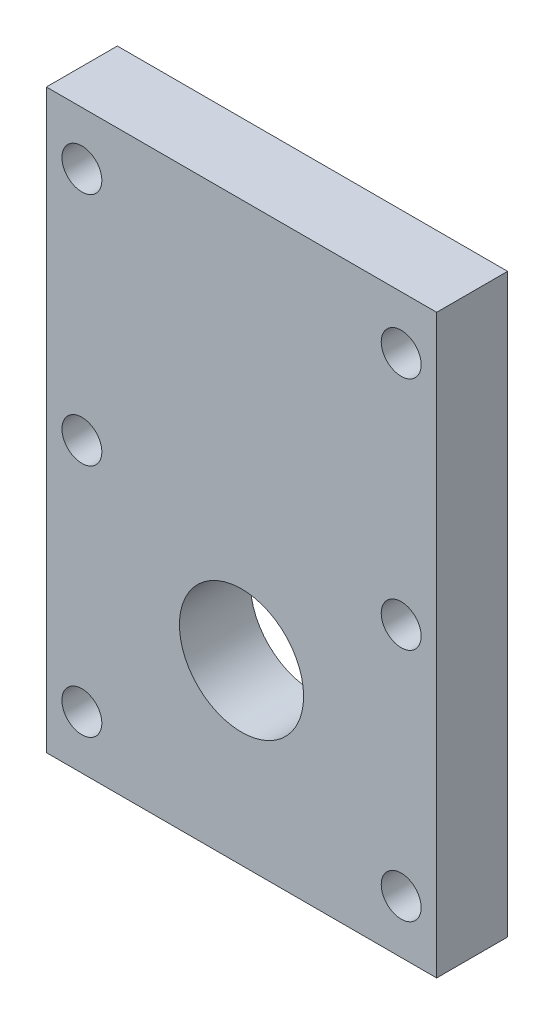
ISO-10303-21;
HEADER;
FILE_DESCRIPTION(('STEP AP214'),'2;1');
FILE_NAME('part.step','',(''),(''),'','','');
FILE_SCHEMA(('AUTOMOTIVE_DESIGN { 1 0 10303 214 1 1 1 1 }'));
ENDSEC;
DATA;
#1=APPLICATION_CONTEXT('core data for automotive mechanical design processes');
#2=APPLICATION_PROTOCOL_DEFINITION('international standard','automotive_design',2000,#1);
#3=PRODUCT_CONTEXT('',#1,'mechanical');
#4=PRODUCT('Part','Part','',(#3));
#5=PRODUCT_RELATED_PRODUCT_CATEGORY('part','',(#4));
#6=PRODUCT_DEFINITION_FORMATION('','',#4);
#7=PRODUCT_DEFINITION_CONTEXT('part definition',#1,'design');
#8=PRODUCT_DEFINITION('design','',#6,#7);
#9=PRODUCT_DEFINITION_SHAPE('','',#8);
#10=(LENGTH_UNIT() NAMED_UNIT(*) SI_UNIT(.MILLI.,.METRE.));
#11=(NAMED_UNIT(*) PLANE_ANGLE_UNIT() SI_UNIT($,.RADIAN.));
#12=(NAMED_UNIT(*) SI_UNIT($,.STERADIAN.) SOLID_ANGLE_UNIT());
#13=UNCERTAINTY_MEASURE_WITH_UNIT(LENGTH_MEASURE(1.E-05),#10,'distance_accuracy_value','');
#14=(GEOMETRIC_REPRESENTATION_CONTEXT(3) GLOBAL_UNCERTAINTY_ASSIGNED_CONTEXT((#13)) GLOBAL_UNIT_ASSIGNED_CONTEXT((#10,
#11,#12)) REPRESENTATION_CONTEXT('',''));
#15=CARTESIAN_POINT('',(0.,0.,0.));
#16=DIRECTION('',(0.,0.,1.));
#17=DIRECTION('',(1.,0.,0.));
#18=AXIS2_PLACEMENT_3D('',#15,#16,#17);
#19=CARTESIAN_POINT('',(-22.,-32.5,8.));
#20=DIRECTION('',(0.,0.,1.));
#21=DIRECTION('',(1.,0.,0.));
#22=AXIS2_PLACEMENT_3D('',#19,#20,#21);
#23=PLANE('',#22);
#24=CARTESIAN_POINT('',(-18.,0.,8.));
#25=DIRECTION('',(0.,0.,-1.));
#26=DIRECTION('',(-1.,0.,0.));
#27=AXIS2_PLACEMENT_3D('',#24,#25,#26);
#28=CIRCLE('',#27,2.25);
#29=CARTESIAN_POINT('',(-20.25,0.,8.));
#30=VERTEX_POINT('',#29);
#31=EDGE_CURVE('E99',#30,#30,#28,.T.);
#32=ORIENTED_EDGE('',*,*,#31,.T.);
#33=EDGE_LOOP('',(#32));
#34=FACE_BOUND('',#33,.T.);
#35=CARTESIAN_POINT('',(-18.,26.5,8.));
#36=DIRECTION('',(0.,0.,-1.));
#37=DIRECTION('',(-1.,0.,0.));
#38=AXIS2_PLACEMENT_3D('',#35,#36,#37);
#39=CIRCLE('',#38,2.25);
#40=CARTESIAN_POINT('',(-20.25,26.5,8.));
#41=VERTEX_POINT('',#40);
#42=EDGE_CURVE('E102',#41,#41,#39,.T.);
#43=ORIENTED_EDGE('',*,*,#42,.T.);
#44=EDGE_LOOP('',(#43));
#45=FACE_BOUND('',#44,.T.);
#46=CARTESIAN_POINT('',(18.,-26.5,8.));
#47=DIRECTION('',(0.,0.,-1.));
#48=DIRECTION('',(-1.,0.,0.));
#49=AXIS2_PLACEMENT_3D('',#46,#47,#48);
#50=CIRCLE('',#49,2.25);
#51=CARTESIAN_POINT('',(15.75,-26.5,8.));
#52=VERTEX_POINT('',#51);
#53=EDGE_CURVE('E105',#52,#52,#50,.T.);
#54=ORIENTED_EDGE('',*,*,#53,.T.);
#55=EDGE_LOOP('',(#54));
#56=FACE_BOUND('',#55,.T.);
#57=DIRECTION('',(0.,1.,0.));
#58=VECTOR('',#57,1.);
#59=CARTESIAN_POINT('',(22.,32.5,8.));
#60=LINE('',#59,#58);
#61=CARTESIAN_POINT('',(22.,-32.5,8.));
#62=VERTEX_POINT('',#61);
#63=CARTESIAN_POINT('',(22.,32.5,8.));
#64=VERTEX_POINT('',#63);
#65=EDGE_CURVE('E55',#62,#64,#60,.T.);
#66=ORIENTED_EDGE('',*,*,#65,.T.);
#67=DIRECTION('',(1.,0.,0.));
#68=VECTOR('',#67,1.);
#69=CARTESIAN_POINT('',(-22.,32.5,8.));
#70=LINE('',#69,#68);
#71=CARTESIAN_POINT('',(-22.,32.5,8.));
#72=VERTEX_POINT('',#71);
#73=EDGE_CURVE('E303',#64,#72,#70,.F.);
#74=ORIENTED_EDGE('',*,*,#73,.T.);
#75=DIRECTION('',(0.,1.,0.));
#76=VECTOR('',#75,1.);
#77=CARTESIAN_POINT('',(-22.,32.5,8.));
#78=LINE('',#77,#76);
#79=CARTESIAN_POINT('',(-22.,-32.5,8.));
#80=VERTEX_POINT('',#79);
#81=EDGE_CURVE('E60',#72,#80,#78,.F.);
#82=ORIENTED_EDGE('',*,*,#81,.T.);
#83=DIRECTION('',(1.,0.,0.));
#84=VECTOR('',#83,1.);
#85=CARTESIAN_POINT('',(-22.,-32.5,8.));
#86=LINE('',#85,#84);
#87=EDGE_CURVE('E58',#80,#62,#86,.T.);
#88=ORIENTED_EDGE('',*,*,#87,.T.);
#89=EDGE_LOOP('',(#66,#74,#82,#88));
#90=FACE_BOUND('',#89,.T.);
#91=CARTESIAN_POINT('',(18.,26.5,8.));
#92=DIRECTION('',(0.,0.,-1.));
#93=DIRECTION('',(-1.,0.,0.));
#94=AXIS2_PLACEMENT_3D('',#91,#92,#93);
#95=CIRCLE('',#94,2.25);
#96=CARTESIAN_POINT('',(15.75,26.5,8.));
#97=VERTEX_POINT('',#96);
#98=EDGE_CURVE('E66',#97,#97,#95,.T.);
#99=ORIENTED_EDGE('',*,*,#98,.T.);
#100=EDGE_LOOP('',(#99));
#101=FACE_BOUND('',#100,.T.);
#102=CARTESIAN_POINT('',(-18.,-26.5,8.));
#103=DIRECTION('',(0.,0.,-1.));
#104=DIRECTION('',(-1.,0.,0.));
#105=AXIS2_PLACEMENT_3D('',#102,#103,#104);
#106=CIRCLE('',#105,2.25);
#107=CARTESIAN_POINT('',(-20.25,-26.5,8.));
#108=VERTEX_POINT('',#107);
#109=EDGE_CURVE('E111',#108,#108,#106,.T.);
#110=ORIENTED_EDGE('',*,*,#109,.T.);
#111=EDGE_LOOP('',(#110));
#112=FACE_BOUND('',#111,.T.);
#113=CARTESIAN_POINT('',(18.,0.,8.));
#114=DIRECTION('',(0.,0.,-1.));
#115=DIRECTION('',(-1.,0.,0.));
#116=AXIS2_PLACEMENT_3D('',#113,#114,#115);
#117=CIRCLE('',#116,2.25);
#118=CARTESIAN_POINT('',(15.75,0.,8.));
#119=VERTEX_POINT('',#118);
#120=EDGE_CURVE('E113',#119,#119,#117,.T.);
#121=ORIENTED_EDGE('',*,*,#120,.T.);
#122=EDGE_LOOP('',(#121));
#123=FACE_BOUND('',#122,.T.);
#124=CARTESIAN_POINT('',(0.,-12.5,8.));
#125=DIRECTION('',(0.,0.,1.));
#126=DIRECTION('',(1.,0.,0.));
#127=AXIS2_PLACEMENT_3D('',#124,#125,#126);
#128=CIRCLE('',#127,7.);
#129=CARTESIAN_POINT('',(7.,-12.5,8.));
#130=VERTEX_POINT('',#129);
#131=EDGE_CURVE('E19',#130,#130,#128,.F.);
#132=ORIENTED_EDGE('',*,*,#131,.T.);
#133=EDGE_LOOP('',(#132));
#134=FACE_BOUND('',#133,.T.);
#135=ADVANCED_FACE('F16',(#34,#45,#56,#90,#101,#112,#123,#134),#23,.T.);
#136=CARTESIAN_POINT('',(0.,-12.5,8.));
#137=DIRECTION('',(0.,0.,1.));
#138=DIRECTION('',(1.,0.,0.));
#139=AXIS2_PLACEMENT_3D('',#136,#137,#138);
#140=CYLINDRICAL_SURFACE('',#139,7.);
#141=CARTESIAN_POINT('',(0.,-12.5,0.));
#142=DIRECTION('',(0.,0.,1.));
#143=DIRECTION('',(1.,0.,0.));
#144=AXIS2_PLACEMENT_3D('',#141,#142,#143);
#145=CIRCLE('',#144,7.);
#146=CARTESIAN_POINT('',(7.,-12.5,0.));
#147=VERTEX_POINT('',#146);
#148=EDGE_CURVE('E96',#147,#147,#145,.F.);
#149=ORIENTED_EDGE('',*,*,#148,.T.);
#150=EDGE_LOOP('',(#149));
#151=FACE_BOUND('',#150,.T.);
#152=ORIENTED_EDGE('',*,*,#131,.F.);
#153=EDGE_LOOP('',(#152));
#154=FACE_BOUND('',#153,.T.);
#155=ADVANCED_FACE('F121',(#151,#154),#140,.F.);
#156=CARTESIAN_POINT('',(18.,0.,8.));
#157=DIRECTION('',(0.,0.,-1.));
#158=DIRECTION('',(-1.,0.,0.));
#159=AXIS2_PLACEMENT_3D('',#156,#157,#158);
#160=CYLINDRICAL_SURFACE('',#159,2.25);
#161=CARTESIAN_POINT('',(18.,0.,0.));
#162=DIRECTION('',(0.,0.,-1.));
#163=DIRECTION('',(-1.,0.,0.));
#164=AXIS2_PLACEMENT_3D('',#161,#162,#163);
#165=CIRCLE('',#164,2.25);
#166=CARTESIAN_POINT('',(15.75,0.,0.));
#167=VERTEX_POINT('',#166);
#168=EDGE_CURVE('E93',#167,#167,#165,.T.);
#169=ORIENTED_EDGE('',*,*,#168,.T.);
#170=EDGE_LOOP('',(#169));
#171=FACE_BOUND('',#170,.T.);
#172=ORIENTED_EDGE('',*,*,#120,.F.);
#173=EDGE_LOOP('',(#172));
#174=FACE_BOUND('',#173,.T.);
#175=ADVANCED_FACE('F123',(#171,#174),#160,.F.);
#176=CARTESIAN_POINT('',(-18.,-26.5,8.));
#177=DIRECTION('',(0.,0.,-1.));
#178=DIRECTION('',(-1.,0.,0.));
#179=AXIS2_PLACEMENT_3D('',#176,#177,#178);
#180=CYLINDRICAL_SURFACE('',#179,2.25);
#181=CARTESIAN_POINT('',(-18.,-26.5,0.));
#182=DIRECTION('',(0.,0.,-1.));
#183=DIRECTION('',(-1.,0.,0.));
#184=AXIS2_PLACEMENT_3D('',#181,#182,#183);
#185=CIRCLE('',#184,2.25);
#186=CARTESIAN_POINT('',(-20.25,-26.5,0.));
#187=VERTEX_POINT('',#186);
#188=EDGE_CURVE('E90',#187,#187,#185,.T.);
#189=ORIENTED_EDGE('',*,*,#188,.T.);
#190=EDGE_LOOP('',(#189));
#191=FACE_BOUND('',#190,.T.);
#192=ORIENTED_EDGE('',*,*,#109,.F.);
#193=EDGE_LOOP('',(#192));
#194=FACE_BOUND('',#193,.T.);
#195=ADVANCED_FACE('F130',(#191,#194),#180,.F.);
#196=CARTESIAN_POINT('',(18.,26.5,8.));
#197=DIRECTION('',(0.,0.,-1.));
#198=DIRECTION('',(-1.,0.,0.));
#199=AXIS2_PLACEMENT_3D('',#196,#197,#198);
#200=CYLINDRICAL_SURFACE('',#199,2.25);
#201=CARTESIAN_POINT('',(18.,26.5,0.));
#202=DIRECTION('',(0.,0.,-1.));
#203=DIRECTION('',(-1.,0.,0.));
#204=AXIS2_PLACEMENT_3D('',#201,#202,#203);
#205=CIRCLE('',#204,2.25);
#206=CARTESIAN_POINT('',(15.75,26.5,0.));
#207=VERTEX_POINT('',#206);
#208=EDGE_CURVE('E87',#207,#207,#205,.T.);
#209=ORIENTED_EDGE('',*,*,#208,.T.);
#210=EDGE_LOOP('',(#209));
#211=FACE_BOUND('',#210,.T.);
#212=ORIENTED_EDGE('',*,*,#98,.F.);
#213=EDGE_LOOP('',(#212));
#214=FACE_BOUND('',#213,.T.);
#215=ADVANCED_FACE('F167',(#211,#214),#200,.F.);
#216=CARTESIAN_POINT('',(-22.,-32.5,8.));
#217=DIRECTION('',(0.,1.,0.));
#218=DIRECTION('',(0.,0.,1.));
#219=AXIS2_PLACEMENT_3D('',#216,#217,#218);
#220=PLANE('',#219);
#221=DIRECTION('',(0.,0.,1.));
#222=VECTOR('',#221,1.);
#223=CARTESIAN_POINT('',(22.,-32.5,8.));
#224=LINE('',#223,#222);
#225=CARTESIAN_POINT('',(22.,-32.5,0.));
#226=VERTEX_POINT('',#225);
#227=EDGE_CURVE('E65',#226,#62,#224,.T.);
#228=ORIENTED_EDGE('',*,*,#227,.T.);
#229=ORIENTED_EDGE('',*,*,#87,.F.);
#230=DIRECTION('',(0.,0.,-1.));
#231=VECTOR('',#230,1.);
#232=CARTESIAN_POINT('',(-22.,-32.5,8.));
#233=LINE('',#232,#231);
#234=CARTESIAN_POINT('',(-22.,-32.5,0.));
#235=VERTEX_POINT('',#234);
#236=EDGE_CURVE('E108',#80,#235,#233,.T.);
#237=ORIENTED_EDGE('',*,*,#236,.T.);
#238=DIRECTION('',(1.,0.,0.));
#239=VECTOR('',#238,1.);
#240=CARTESIAN_POINT('',(-22.,-32.5,0.));
#241=LINE('',#240,#239);
#242=EDGE_CURVE('E77',#235,#226,#241,.T.);
#243=ORIENTED_EDGE('',*,*,#242,.T.);
#244=EDGE_LOOP('',(#228,#229,#237,#243));
#245=FACE_BOUND('',#244,.T.);
#246=ADVANCED_FACE('F76',(#245),#220,.F.);
#247=CARTESIAN_POINT('',(22.,32.5,8.));
#248=DIRECTION('',(-1.,0.,0.));
#249=DIRECTION('',(0.,0.,1.));
#250=AXIS2_PLACEMENT_3D('',#247,#248,#249);
#251=PLANE('',#250);
#252=DIRECTION('',(0.,0.,-1.));
#253=VECTOR('',#252,1.);
#254=CARTESIAN_POINT('',(22.,32.5,8.));
#255=LINE('',#254,#253);
#256=CARTESIAN_POINT('',(22.,32.5,0.));
#257=VERTEX_POINT('',#256);
#258=EDGE_CURVE('E73',#257,#64,#255,.F.);
#259=ORIENTED_EDGE('',*,*,#258,.T.);
#260=ORIENTED_EDGE('',*,*,#65,.F.);
#261=ORIENTED_EDGE('',*,*,#227,.F.);
#262=DIRECTION('',(0.,1.,0.));
#263=VECTOR('',#262,1.);
#264=CARTESIAN_POINT('',(22.,-32.5,0.));
#265=LINE('',#264,#263);
#266=EDGE_CURVE('E312',#226,#257,#265,.T.);
#267=ORIENTED_EDGE('',*,*,#266,.T.);
#268=EDGE_LOOP('',(#259,#260,#261,#267));
#269=FACE_BOUND('',#268,.T.);
#270=ADVANCED_FACE('F70',(#269),#251,.F.);
#271=CARTESIAN_POINT('',(-22.,32.5,8.));
#272=DIRECTION('',(0.,-1.,0.));
#273=DIRECTION('',(0.,0.,-1.));
#274=AXIS2_PLACEMENT_3D('',#271,#272,#273);
#275=PLANE('',#274);
#276=DIRECTION('',(0.,0.,-1.));
#277=VECTOR('',#276,1.);
#278=CARTESIAN_POINT('',(-22.,32.5,8.));
#279=LINE('',#278,#277);
#280=CARTESIAN_POINT('',(-22.,32.5,0.));
#281=VERTEX_POINT('',#280);
#282=EDGE_CURVE('E34',#281,#72,#279,.F.);
#283=ORIENTED_EDGE('',*,*,#282,.T.);
#284=ORIENTED_EDGE('',*,*,#73,.F.);
#285=ORIENTED_EDGE('',*,*,#258,.F.);
#286=DIRECTION('',(1.,0.,0.));
#287=VECTOR('',#286,1.);
#288=CARTESIAN_POINT('',(-22.,32.5,0.));
#289=LINE('',#288,#287);
#290=EDGE_CURVE('E305',#257,#281,#289,.F.);
#291=ORIENTED_EDGE('',*,*,#290,.T.);
#292=EDGE_LOOP('',(#283,#284,#285,#291));
#293=FACE_BOUND('',#292,.T.);
#294=ADVANCED_FACE('F159',(#293),#275,.F.);
#295=CARTESIAN_POINT('',(-22.,32.5,8.));
#296=DIRECTION('',(1.,0.,0.));
#297=DIRECTION('',(0.,0.,-1.));
#298=AXIS2_PLACEMENT_3D('',#295,#296,#297);
#299=PLANE('',#298);
#300=ORIENTED_EDGE('',*,*,#236,.F.);
#301=ORIENTED_EDGE('',*,*,#81,.F.);
#302=ORIENTED_EDGE('',*,*,#282,.F.);
#303=DIRECTION('',(0.,1.,0.));
#304=VECTOR('',#303,1.);
#305=CARTESIAN_POINT('',(-22.,-32.5,0.));
#306=LINE('',#305,#304);
#307=EDGE_CURVE('E86',#281,#235,#306,.F.);
#308=ORIENTED_EDGE('',*,*,#307,.T.);
#309=EDGE_LOOP('',(#300,#301,#302,#308));
#310=FACE_BOUND('',#309,.T.);
#311=ADVANCED_FACE('F155',(#310),#299,.F.);
#312=CARTESIAN_POINT('',(18.,-26.5,8.));
#313=DIRECTION('',(0.,0.,-1.));
#314=DIRECTION('',(-1.,0.,0.));
#315=AXIS2_PLACEMENT_3D('',#312,#313,#314);
#316=CYLINDRICAL_SURFACE('',#315,2.25);
#317=CARTESIAN_POINT('',(18.,-26.5,0.));
#318=DIRECTION('',(0.,0.,-1.));
#319=DIRECTION('',(-1.,0.,0.));
#320=AXIS2_PLACEMENT_3D('',#317,#318,#319);
#321=CIRCLE('',#320,2.25);
#322=CARTESIAN_POINT('',(15.75,-26.5,0.));
#323=VERTEX_POINT('',#322);
#324=EDGE_CURVE('E83',#323,#323,#321,.T.);
#325=ORIENTED_EDGE('',*,*,#324,.T.);
#326=EDGE_LOOP('',(#325));
#327=FACE_BOUND('',#326,.T.);
#328=ORIENTED_EDGE('',*,*,#53,.F.);
#329=EDGE_LOOP('',(#328));
#330=FACE_BOUND('',#329,.T.);
#331=ADVANCED_FACE('F151',(#327,#330),#316,.F.);
#332=CARTESIAN_POINT('',(-18.,26.5,8.));
#333=DIRECTION('',(0.,0.,-1.));
#334=DIRECTION('',(-1.,0.,0.));
#335=AXIS2_PLACEMENT_3D('',#332,#333,#334);
#336=CYLINDRICAL_SURFACE('',#335,2.25);
#337=CARTESIAN_POINT('',(-18.,26.5,0.));
#338=DIRECTION('',(0.,0.,-1.));
#339=DIRECTION('',(-1.,0.,0.));
#340=AXIS2_PLACEMENT_3D('',#337,#338,#339);
#341=CIRCLE('',#340,2.25);
#342=CARTESIAN_POINT('',(-20.25,26.5,0.));
#343=VERTEX_POINT('',#342);
#344=EDGE_CURVE('E25',#343,#343,#341,.T.);
#345=ORIENTED_EDGE('',*,*,#344,.T.);
#346=EDGE_LOOP('',(#345));
#347=FACE_BOUND('',#346,.T.);
#348=ORIENTED_EDGE('',*,*,#42,.F.);
#349=EDGE_LOOP('',(#348));
#350=FACE_BOUND('',#349,.T.);
#351=ADVANCED_FACE('F143',(#347,#350),#336,.F.);
#352=CARTESIAN_POINT('',(-18.,0.,8.));
#353=DIRECTION('',(0.,0.,-1.));
#354=DIRECTION('',(-1.,0.,0.));
#355=AXIS2_PLACEMENT_3D('',#352,#353,#354);
#356=CYLINDRICAL_SURFACE('',#355,2.25);
#357=CARTESIAN_POINT('',(-18.,0.,0.));
#358=DIRECTION('',(0.,0.,-1.));
#359=DIRECTION('',(-1.,0.,0.));
#360=AXIS2_PLACEMENT_3D('',#357,#358,#359);
#361=CIRCLE('',#360,2.25);
#362=CARTESIAN_POINT('',(-20.25,0.,0.));
#363=VERTEX_POINT('',#362);
#364=EDGE_CURVE('E11',#363,#363,#361,.T.);
#365=ORIENTED_EDGE('',*,*,#364,.T.);
#366=EDGE_LOOP('',(#365));
#367=FACE_BOUND('',#366,.T.);
#368=ORIENTED_EDGE('',*,*,#31,.F.);
#369=EDGE_LOOP('',(#368));
#370=FACE_BOUND('',#369,.T.);
#371=ADVANCED_FACE('F137',(#367,#370),#356,.F.);
#372=CARTESIAN_POINT('',(-22.,-32.5,0.));
#373=DIRECTION('',(0.,0.,1.));
#374=DIRECTION('',(1.,0.,0.));
#375=AXIS2_PLACEMENT_3D('',#372,#373,#374);
#376=PLANE('',#375);
#377=ORIENTED_EDGE('',*,*,#364,.F.);
#378=EDGE_LOOP('',(#377));
#379=FACE_BOUND('',#378,.T.);
#380=ORIENTED_EDGE('',*,*,#344,.F.);
#381=EDGE_LOOP('',(#380));
#382=FACE_BOUND('',#381,.T.);
#383=ORIENTED_EDGE('',*,*,#324,.F.);
#384=EDGE_LOOP('',(#383));
#385=FACE_BOUND('',#384,.T.);
#386=ORIENTED_EDGE('',*,*,#290,.F.);
#387=ORIENTED_EDGE('',*,*,#266,.F.);
#388=ORIENTED_EDGE('',*,*,#242,.F.);
#389=ORIENTED_EDGE('',*,*,#307,.F.);
#390=EDGE_LOOP('',(#386,#387,#388,#389));
#391=FACE_BOUND('',#390,.T.);
#392=ORIENTED_EDGE('',*,*,#208,.F.);
#393=EDGE_LOOP('',(#392));
#394=FACE_BOUND('',#393,.T.);
#395=ORIENTED_EDGE('',*,*,#188,.F.);
#396=EDGE_LOOP('',(#395));
#397=FACE_BOUND('',#396,.T.);
#398=ORIENTED_EDGE('',*,*,#168,.F.);
#399=EDGE_LOOP('',(#398));
#400=FACE_BOUND('',#399,.T.);
#401=ORIENTED_EDGE('',*,*,#148,.F.);
#402=EDGE_LOOP('',(#401));
#403=FACE_BOUND('',#402,.T.);
#404=ADVANCED_FACE('F135',(#379,#382,#385,#391,#394,#397,#400,#403),#376,.F.);
#405=CLOSED_SHELL('',(#135,#155,#175,#195,#215,#246,#270,#294,#311,#331,#351,#371,#404));
#406=MANIFOLD_SOLID_BREP('B1',#405);
#407=ADVANCED_BREP_SHAPE_REPRESENTATION('',(#18,#406),#14);
#408=SHAPE_DEFINITION_REPRESENTATION(#9,#407);
ENDSEC;
END-ISO-10303-21;
